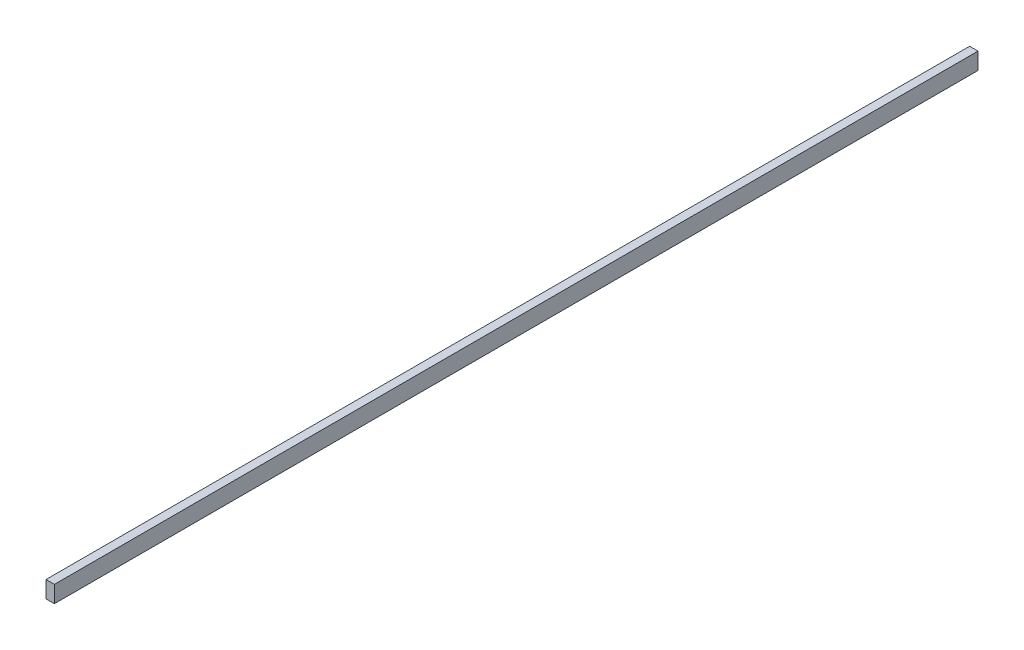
ISO-10303-21;
HEADER;
FILE_DESCRIPTION(('STEP AP214'),'2;1');
FILE_NAME('part.step','',(''),(''),'','','');
FILE_SCHEMA(('AUTOMOTIVE_DESIGN { 1 0 10303 214 1 1 1 1 }'));
ENDSEC;
DATA;
#1=APPLICATION_CONTEXT('core data for automotive mechanical design processes');
#2=APPLICATION_PROTOCOL_DEFINITION('international standard','automotive_design',2000,#1);
#3=PRODUCT_CONTEXT('',#1,'mechanical');
#4=PRODUCT('Part','Part','',(#3));
#5=PRODUCT_RELATED_PRODUCT_CATEGORY('part','',(#4));
#6=PRODUCT_DEFINITION_FORMATION('','',#4);
#7=PRODUCT_DEFINITION_CONTEXT('part definition',#1,'design');
#8=PRODUCT_DEFINITION('design','',#6,#7);
#9=PRODUCT_DEFINITION_SHAPE('','',#8);
#10=(LENGTH_UNIT() NAMED_UNIT(*) SI_UNIT(.MILLI.,.METRE.));
#11=(NAMED_UNIT(*) PLANE_ANGLE_UNIT() SI_UNIT($,.RADIAN.));
#12=(NAMED_UNIT(*) SI_UNIT($,.STERADIAN.) SOLID_ANGLE_UNIT());
#13=UNCERTAINTY_MEASURE_WITH_UNIT(LENGTH_MEASURE(1.E-05),#10,'distance_accuracy_value','');
#14=(GEOMETRIC_REPRESENTATION_CONTEXT(3) GLOBAL_UNCERTAINTY_ASSIGNED_CONTEXT((#13)) GLOBAL_UNIT_ASSIGNED_CONTEXT((#10,
#11,#12)) REPRESENTATION_CONTEXT('',''));
#15=CARTESIAN_POINT('',(0.,0.,0.));
#16=DIRECTION('',(0.,0.,1.));
#17=DIRECTION('',(1.,0.,0.));
#18=AXIS2_PLACEMENT_3D('',#15,#16,#17);
#19=CARTESIAN_POINT('',(5.,0.,0.));
#20=DIRECTION('',(0.,0.,-1.));
#21=DIRECTION('',(0.,1.,0.));
#22=AXIS2_PLACEMENT_3D('',#19,#20,#21);
#23=PLANE('',#22);
#24=DIRECTION('',(0.,-1.,0.));
#25=VECTOR('',#24,1.);
#26=CARTESIAN_POINT('',(0.,0.,0.));
#27=LINE('',#26,#25);
#28=CARTESIAN_POINT('',(0.,10.,0.));
#29=VERTEX_POINT('',#28);
#30=CARTESIAN_POINT('',(0.,0.,0.));
#31=VERTEX_POINT('',#30);
#32=EDGE_CURVE('E70',#29,#31,#27,.T.);
#33=ORIENTED_EDGE('',*,*,#32,.T.);
#34=DIRECTION('',(-1.,0.,0.));
#35=VECTOR('',#34,1.);
#36=CARTESIAN_POINT('',(5.,0.,0.));
#37=LINE('',#36,#35);
#38=CARTESIAN_POINT('',(5.,0.,0.));
#39=VERTEX_POINT('',#38);
#40=EDGE_CURVE('E11',#39,#31,#37,.T.);
#41=ORIENTED_EDGE('',*,*,#40,.F.);
#42=DIRECTION('',(0.,-1.,0.));
#43=VECTOR('',#42,1.);
#44=CARTESIAN_POINT('',(5.,0.,0.));
#45=LINE('',#44,#43);
#46=CARTESIAN_POINT('',(5.,10.,0.));
#47=VERTEX_POINT('',#46);
#48=EDGE_CURVE('E88',#47,#39,#45,.T.);
#49=ORIENTED_EDGE('',*,*,#48,.F.);
#50=DIRECTION('',(-1.,0.,0.));
#51=VECTOR('',#50,1.);
#52=CARTESIAN_POINT('',(5.,10.,0.));
#53=LINE('',#52,#51);
#54=EDGE_CURVE('E82',#47,#29,#53,.T.);
#55=ORIENTED_EDGE('',*,*,#54,.T.);
#56=EDGE_LOOP('',(#33,#41,#49,#55));
#57=FACE_BOUND('',#56,.T.);
#58=ADVANCED_FACE('F26',(#57),#23,.F.);
#59=CARTESIAN_POINT('',(5.,0.,0.));
#60=DIRECTION('',(0.,1.,0.));
#61=DIRECTION('',(0.,0.,1.));
#62=AXIS2_PLACEMENT_3D('',#59,#60,#61);
#63=PLANE('',#62);
#64=DIRECTION('',(0.,0.,-1.));
#65=VECTOR('',#64,1.);
#66=CARTESIAN_POINT('',(0.,0.,0.));
#67=LINE('',#66,#65);
#68=CARTESIAN_POINT('',(0.,0.,-550.));
#69=VERTEX_POINT('',#68);
#70=EDGE_CURVE('E66',#31,#69,#67,.T.);
#71=ORIENTED_EDGE('',*,*,#70,.T.);
#72=DIRECTION('',(-1.,0.,0.));
#73=VECTOR('',#72,1.);
#74=CARTESIAN_POINT('',(5.,0.,-550.));
#75=LINE('',#74,#73);
#76=CARTESIAN_POINT('',(5.,0.,-550.));
#77=VERTEX_POINT('',#76);
#78=EDGE_CURVE('E33',#77,#69,#75,.T.);
#79=ORIENTED_EDGE('',*,*,#78,.F.);
#80=DIRECTION('',(0.,0.,-1.));
#81=VECTOR('',#80,1.);
#82=CARTESIAN_POINT('',(5.,0.,0.));
#83=LINE('',#82,#81);
#84=EDGE_CURVE('E78',#39,#77,#83,.T.);
#85=ORIENTED_EDGE('',*,*,#84,.F.);
#86=ORIENTED_EDGE('',*,*,#40,.T.);
#87=EDGE_LOOP('',(#71,#79,#85,#86));
#88=FACE_BOUND('',#87,.T.);
#89=ADVANCED_FACE('F77',(#88),#63,.F.);
#90=CARTESIAN_POINT('',(5.,0.,-550.));
#91=DIRECTION('',(0.,0.,1.));
#92=DIRECTION('',(1.,0.,0.));
#93=AXIS2_PLACEMENT_3D('',#90,#91,#92);
#94=PLANE('',#93);
#95=DIRECTION('',(0.,1.,0.));
#96=VECTOR('',#95,1.);
#97=CARTESIAN_POINT('',(0.,0.,-550.));
#98=LINE('',#97,#96);
#99=CARTESIAN_POINT('',(0.,10.,-550.));
#100=VERTEX_POINT('',#99);
#101=EDGE_CURVE('E71',#69,#100,#98,.T.);
#102=ORIENTED_EDGE('',*,*,#101,.T.);
#103=DIRECTION('',(-1.,0.,0.));
#104=VECTOR('',#103,1.);
#105=CARTESIAN_POINT('',(5.,10.,-550.));
#106=LINE('',#105,#104);
#107=CARTESIAN_POINT('',(5.,10.,-550.));
#108=VERTEX_POINT('',#107);
#109=EDGE_CURVE('E94',#108,#100,#106,.T.);
#110=ORIENTED_EDGE('',*,*,#109,.F.);
#111=DIRECTION('',(0.,1.,0.));
#112=VECTOR('',#111,1.);
#113=CARTESIAN_POINT('',(5.,0.,-550.));
#114=LINE('',#113,#112);
#115=EDGE_CURVE('E45',#77,#108,#114,.T.);
#116=ORIENTED_EDGE('',*,*,#115,.F.);
#117=ORIENTED_EDGE('',*,*,#78,.T.);
#118=EDGE_LOOP('',(#102,#110,#116,#117));
#119=FACE_BOUND('',#118,.T.);
#120=ADVANCED_FACE('F97',(#119),#94,.F.);
#121=CARTESIAN_POINT('',(5.,10.,0.));
#122=DIRECTION('',(0.,-1.,0.));
#123=DIRECTION('',(0.,0.,-1.));
#124=AXIS2_PLACEMENT_3D('',#121,#122,#123);
#125=PLANE('',#124);
#126=DIRECTION('',(0.,0.,1.));
#127=VECTOR('',#126,1.);
#128=CARTESIAN_POINT('',(0.,10.,0.));
#129=LINE('',#128,#127);
#130=EDGE_CURVE('E86',#100,#29,#129,.T.);
#131=ORIENTED_EDGE('',*,*,#130,.T.);
#132=ORIENTED_EDGE('',*,*,#54,.F.);
#133=DIRECTION('',(0.,0.,1.));
#134=VECTOR('',#133,1.);
#135=CARTESIAN_POINT('',(5.,10.,0.));
#136=LINE('',#135,#134);
#137=EDGE_CURVE('E40',#108,#47,#136,.T.);
#138=ORIENTED_EDGE('',*,*,#137,.F.);
#139=ORIENTED_EDGE('',*,*,#109,.T.);
#140=EDGE_LOOP('',(#131,#132,#138,#139));
#141=FACE_BOUND('',#140,.T.);
#142=ADVANCED_FACE('F99',(#141),#125,.F.);
#143=CARTESIAN_POINT('',(5.,10.,0.));
#144=DIRECTION('',(-1.,0.,0.));
#145=DIRECTION('',(0.,0.,1.));
#146=AXIS2_PLACEMENT_3D('',#143,#144,#145);
#147=PLANE('',#146);
#148=ORIENTED_EDGE('',*,*,#48,.T.);
#149=ORIENTED_EDGE('',*,*,#84,.T.);
#150=ORIENTED_EDGE('',*,*,#115,.T.);
#151=ORIENTED_EDGE('',*,*,#137,.T.);
#152=EDGE_LOOP('',(#148,#149,#150,#151));
#153=FACE_BOUND('',#152,.T.);
#154=ADVANCED_FACE('F100',(#153),#147,.F.);
#155=CARTESIAN_POINT('',(0.,10.,0.));
#156=DIRECTION('',(-1.,0.,0.));
#157=DIRECTION('',(0.,0.,1.));
#158=AXIS2_PLACEMENT_3D('',#155,#156,#157);
#159=PLANE('',#158);
#160=ORIENTED_EDGE('',*,*,#32,.F.);
#161=ORIENTED_EDGE('',*,*,#130,.F.);
#162=ORIENTED_EDGE('',*,*,#101,.F.);
#163=ORIENTED_EDGE('',*,*,#70,.F.);
#164=EDGE_LOOP('',(#160,#161,#162,#163));
#165=FACE_BOUND('',#164,.T.);
#166=ADVANCED_FACE('F67',(#165),#159,.T.);
#167=CLOSED_SHELL('',(#58,#89,#120,#142,#154,#166));
#168=MANIFOLD_SOLID_BREP('B2',#167);
#169=ADVANCED_BREP_SHAPE_REPRESENTATION('',(#18,#168),#14);
#170=SHAPE_DEFINITION_REPRESENTATION(#9,#169);
ENDSEC;
END-ISO-10303-21;
